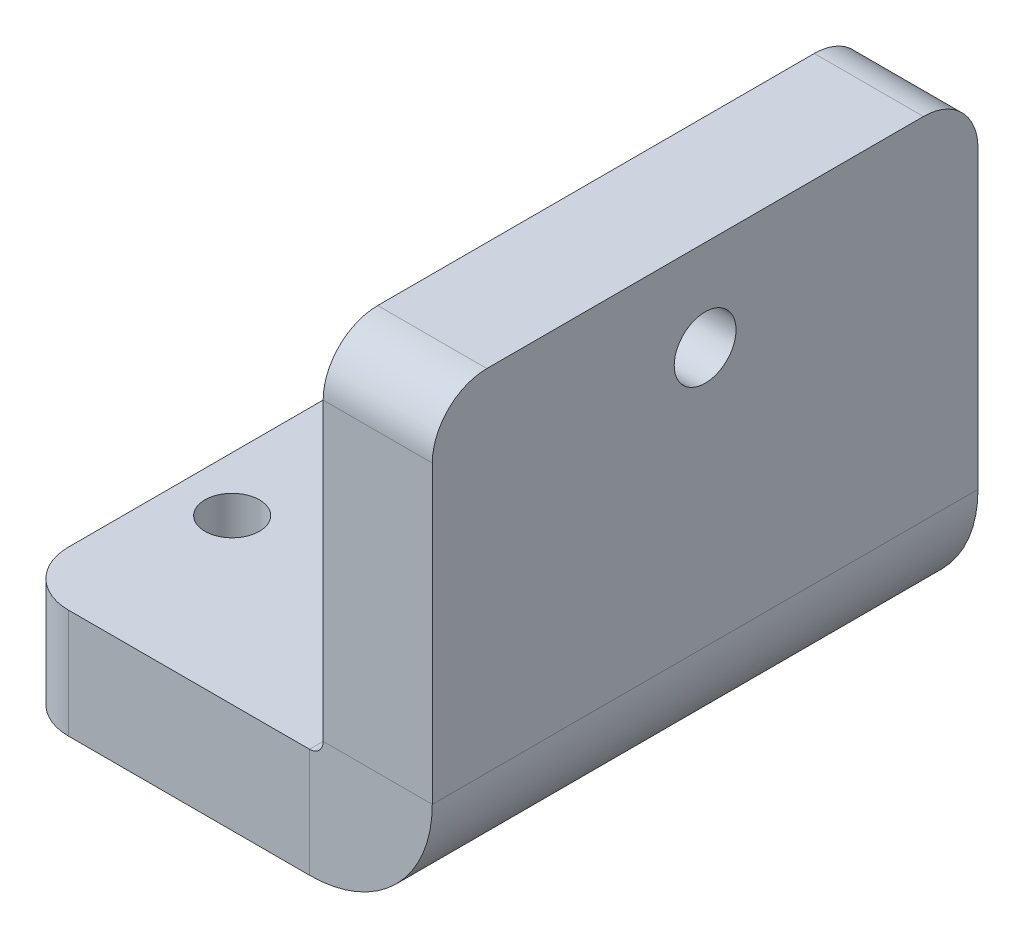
ISO-10303-21;
HEADER;
FILE_DESCRIPTION(('STEP AP214'),'2;1');
FILE_NAME('part.step','',(''),(''),'','','');
FILE_SCHEMA(('AUTOMOTIVE_DESIGN { 1 0 10303 214 1 1 1 1 }'));
ENDSEC;
DATA;
#1=APPLICATION_CONTEXT('core data for automotive mechanical design processes');
#2=APPLICATION_PROTOCOL_DEFINITION('international standard','automotive_design',2000,#1);
#3=PRODUCT_CONTEXT('',#1,'mechanical');
#4=PRODUCT('Part','Part','',(#3));
#5=PRODUCT_RELATED_PRODUCT_CATEGORY('part','',(#4));
#6=PRODUCT_DEFINITION_FORMATION('','',#4);
#7=PRODUCT_DEFINITION_CONTEXT('part definition',#1,'design');
#8=PRODUCT_DEFINITION('design','',#6,#7);
#9=PRODUCT_DEFINITION_SHAPE('','',#8);
#10=(LENGTH_UNIT() NAMED_UNIT(*) SI_UNIT(.MILLI.,.METRE.));
#11=(NAMED_UNIT(*) PLANE_ANGLE_UNIT() SI_UNIT($,.RADIAN.));
#12=(NAMED_UNIT(*) SI_UNIT($,.STERADIAN.) SOLID_ANGLE_UNIT());
#13=UNCERTAINTY_MEASURE_WITH_UNIT(LENGTH_MEASURE(1.E-05),#10,'distance_accuracy_value','');
#14=(GEOMETRIC_REPRESENTATION_CONTEXT(3) GLOBAL_UNCERTAINTY_ASSIGNED_CONTEXT((#13)) GLOBAL_UNIT_ASSIGNED_CONTEXT((#10,
#11,#12)) REPRESENTATION_CONTEXT('',''));
#15=CARTESIAN_POINT('',(0.,0.,0.));
#16=DIRECTION('',(0.,0.,1.));
#17=DIRECTION('',(1.,0.,0.));
#18=AXIS2_PLACEMENT_3D('',#15,#16,#17);
#19=CARTESIAN_POINT('',(0.,0.75,15.));
#20=DIRECTION('',(0.,0.,1.));
#21=DIRECTION('',(1.,0.,0.));
#22=AXIS2_PLACEMENT_3D('',#19,#20,#21);
#23=PLANE('',#22);
#24=DIRECTION('',(1.,0.,0.));
#25=VECTOR('',#24,1.);
#26=CARTESIAN_POINT('',(0.,0.75,15.));
#27=LINE('',#26,#25);
#28=CARTESIAN_POINT('',(0.,0.75,15.));
#29=VERTEX_POINT('',#28);
#30=CARTESIAN_POINT('',(6.,0.75,15.));
#31=VERTEX_POINT('',#30);
#32=EDGE_CURVE('E134',#29,#31,#27,.T.);
#33=ORIENTED_EDGE('',*,*,#32,.F.);
#34=CARTESIAN_POINT('',(-0.75,0.75,15.));
#35=DIRECTION('',(0.,0.,-1.));
#36=DIRECTION('',(-1.,0.,0.));
#37=AXIS2_PLACEMENT_3D('',#34,#35,#36);
#38=CIRCLE('',#37,0.75);
#39=CARTESIAN_POINT('',(-0.750000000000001,0.,15.));
#40=VERTEX_POINT('',#39);
#41=EDGE_CURVE('E138',#40,#29,#38,.F.);
#42=ORIENTED_EDGE('',*,*,#41,.F.);
#43=DIRECTION('',(0.,1.,0.));
#44=VECTOR('',#43,1.);
#45=CARTESIAN_POINT('',(-0.750000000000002,-6.,15.));
#46=LINE('',#45,#44);
#47=CARTESIAN_POINT('',(-0.750000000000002,-6.,15.));
#48=VERTEX_POINT('',#47);
#49=EDGE_CURVE('E143',#48,#40,#46,.T.);
#50=ORIENTED_EDGE('',*,*,#49,.F.);
#51=CARTESIAN_POINT('',(-0.75,0.75,15.));
#52=DIRECTION('',(0.,0.,1.));
#53=DIRECTION('',(1.,0.,0.));
#54=AXIS2_PLACEMENT_3D('',#51,#52,#53);
#55=CIRCLE('',#54,6.75);
#56=EDGE_CURVE('E140',#48,#31,#55,.T.);
#57=ORIENTED_EDGE('',*,*,#56,.T.);
#58=EDGE_LOOP('',(#33,#42,#50,#57));
#59=FACE_BOUND('',#58,.T.);
#60=ADVANCED_FACE('F43',(#59),#23,.T.);
#61=CARTESIAN_POINT('',(-0.750000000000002,-6.,15.));
#62=DIRECTION('',(0.,0.,1.));
#63=DIRECTION('',(1.,0.,0.));
#64=AXIS2_PLACEMENT_3D('',#61,#62,#63);
#65=PLANE('',#64);
#66=DIRECTION('',(0.,1.,0.));
#67=VECTOR('',#66,1.);
#68=CARTESIAN_POINT('',(6.,0.,15.));
#69=LINE('',#68,#67);
#70=CARTESIAN_POINT('',(6.,17.,15.));
#71=VERTEX_POINT('',#70);
#72=EDGE_CURVE('E161',#31,#71,#69,.T.);
#73=ORIENTED_EDGE('',*,*,#72,.T.);
#74=DIRECTION('',(1.,0.,0.));
#75=VECTOR('',#74,1.);
#76=CARTESIAN_POINT('',(-0.750000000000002,17.,15.));
#77=LINE('',#76,#75);
#78=CARTESIAN_POINT('',(0.,17.,15.));
#79=VERTEX_POINT('',#78);
#80=EDGE_CURVE('E51',#71,#79,#77,.F.);
#81=ORIENTED_EDGE('',*,*,#80,.T.);
#82=DIRECTION('',(0.,1.,0.));
#83=VECTOR('',#82,1.);
#84=CARTESIAN_POINT('',(0.,0.,15.));
#85=LINE('',#84,#83);
#86=EDGE_CURVE('E150',#29,#79,#85,.T.);
#87=ORIENTED_EDGE('',*,*,#86,.F.);
#88=ORIENTED_EDGE('',*,*,#32,.T.);
#89=EDGE_LOOP('',(#73,#81,#87,#88));
#90=FACE_BOUND('',#89,.T.);
#91=ADVANCED_FACE('F160',(#90),#65,.T.);
#92=CARTESIAN_POINT('',(-0.750000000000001,0.,-15.));
#93=DIRECTION('',(0.,0.,-1.));
#94=DIRECTION('',(-1.,0.,0.));
#95=AXIS2_PLACEMENT_3D('',#92,#93,#94);
#96=PLANE('',#95);
#97=DIRECTION('',(0.,-1.,0.));
#98=VECTOR('',#97,1.);
#99=CARTESIAN_POINT('',(-0.750000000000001,0.,-15.));
#100=LINE('',#99,#98);
#101=CARTESIAN_POINT('',(-0.750000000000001,0.,-15.));
#102=VERTEX_POINT('',#101);
#103=CARTESIAN_POINT('',(-0.750000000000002,-6.,-15.));
#104=VERTEX_POINT('',#103);
#105=EDGE_CURVE('E206',#102,#104,#100,.T.);
#106=ORIENTED_EDGE('',*,*,#105,.F.);
#107=CARTESIAN_POINT('',(-0.75,0.75,-15.));
#108=DIRECTION('',(0.,0.,-1.));
#109=DIRECTION('',(-1.,0.,0.));
#110=AXIS2_PLACEMENT_3D('',#107,#108,#109);
#111=CIRCLE('',#110,0.75);
#112=CARTESIAN_POINT('',(0.,0.75,-15.));
#113=VERTEX_POINT('',#112);
#114=EDGE_CURVE('E180',#102,#113,#111,.F.);
#115=ORIENTED_EDGE('',*,*,#114,.T.);
#116=DIRECTION('',(-1.,0.,0.));
#117=VECTOR('',#116,1.);
#118=CARTESIAN_POINT('',(6.,0.75,-15.));
#119=LINE('',#118,#117);
#120=CARTESIAN_POINT('',(6.,0.75,-15.));
#121=VERTEX_POINT('',#120);
#122=EDGE_CURVE('E204',#121,#113,#119,.T.);
#123=ORIENTED_EDGE('',*,*,#122,.F.);
#124=CARTESIAN_POINT('',(-0.75,0.75,-15.));
#125=DIRECTION('',(0.,0.,1.));
#126=DIRECTION('',(1.,0.,0.));
#127=AXIS2_PLACEMENT_3D('',#124,#125,#126);
#128=CIRCLE('',#127,6.75);
#129=EDGE_CURVE('E186',#104,#121,#128,.T.);
#130=ORIENTED_EDGE('',*,*,#129,.F.);
#131=EDGE_LOOP('',(#106,#115,#123,#130));
#132=FACE_BOUND('',#131,.T.);
#133=ADVANCED_FACE('F299',(#132),#96,.T.);
#134=CARTESIAN_POINT('',(6.,0.75,-15.));
#135=DIRECTION('',(0.,0.,-1.));
#136=DIRECTION('',(-1.,0.,0.));
#137=AXIS2_PLACEMENT_3D('',#134,#135,#136);
#138=PLANE('',#137);
#139=DIRECTION('',(1.,0.,0.));
#140=VECTOR('',#139,1.);
#141=CARTESIAN_POINT('',(-17.,-6.,-15.));
#142=LINE('',#141,#140);
#143=CARTESIAN_POINT('',(-14.,-6.,-15.));
#144=VERTEX_POINT('',#143);
#145=EDGE_CURVE('E184',#144,#104,#142,.T.);
#146=ORIENTED_EDGE('',*,*,#145,.F.);
#147=DIRECTION('',(0.,1.,0.));
#148=VECTOR('',#147,1.);
#149=CARTESIAN_POINT('',(-14.,0.75,-15.));
#150=LINE('',#149,#148);
#151=CARTESIAN_POINT('',(-14.,0.,-15.));
#152=VERTEX_POINT('',#151);
#153=EDGE_CURVE('E142',#144,#152,#150,.T.);
#154=ORIENTED_EDGE('',*,*,#153,.T.);
#155=DIRECTION('',(1.,0.,0.));
#156=VECTOR('',#155,1.);
#157=CARTESIAN_POINT('',(-17.,0.,-15.));
#158=LINE('',#157,#156);
#159=EDGE_CURVE('E182',#152,#102,#158,.T.);
#160=ORIENTED_EDGE('',*,*,#159,.T.);
#161=ORIENTED_EDGE('',*,*,#105,.T.);
#162=EDGE_LOOP('',(#146,#154,#160,#161));
#163=FACE_BOUND('',#162,.T.);
#164=ADVANCED_FACE('F336',(#163),#138,.T.);
#165=CARTESIAN_POINT('',(6.,0.,15.));
#166=DIRECTION('',(-1.,0.,0.));
#167=DIRECTION('',(0.,0.,1.));
#168=AXIS2_PLACEMENT_3D('',#165,#166,#167);
#169=PLANE('',#168);
#170=CARTESIAN_POINT('',(6.,15.,0.));
#171=DIRECTION('',(-1.,0.,0.));
#172=DIRECTION('',(0.,0.,1.));
#173=AXIS2_PLACEMENT_3D('',#170,#171,#172);
#174=CIRCLE('',#173,1.7);
#175=CARTESIAN_POINT('',(6.,15.,1.7));
#176=VERTEX_POINT('',#175);
#177=EDGE_CURVE('E260',#176,#176,#174,.T.);
#178=ORIENTED_EDGE('',*,*,#177,.T.);
#179=EDGE_LOOP('',(#178));
#180=FACE_BOUND('',#179,.T.);
#181=DIRECTION('',(0.,1.,0.));
#182=VECTOR('',#181,1.);
#183=CARTESIAN_POINT('',(6.,0.,-15.));
#184=LINE('',#183,#182);
#185=CARTESIAN_POINT('',(6.,17.,-15.));
#186=VERTEX_POINT('',#185);
#187=EDGE_CURVE('E175',#121,#186,#184,.T.);
#188=ORIENTED_EDGE('',*,*,#187,.T.);
#189=CARTESIAN_POINT('',(6.,17.,-12.));
#190=DIRECTION('',(-1.,0.,0.));
#191=DIRECTION('',(0.,0.,1.));
#192=AXIS2_PLACEMENT_3D('',#189,#190,#191);
#193=CIRCLE('',#192,3.);
#194=CARTESIAN_POINT('',(6.,20.,-12.));
#195=VERTEX_POINT('',#194);
#196=EDGE_CURVE('E231',#186,#195,#193,.F.);
#197=ORIENTED_EDGE('',*,*,#196,.T.);
#198=DIRECTION('',(0.,0.,-1.));
#199=VECTOR('',#198,1.);
#200=CARTESIAN_POINT('',(6.,20.,15.));
#201=LINE('',#200,#199);
#202=CARTESIAN_POINT('',(6.,20.,12.));
#203=VERTEX_POINT('',#202);
#204=EDGE_CURVE('E202',#203,#195,#201,.T.);
#205=ORIENTED_EDGE('',*,*,#204,.F.);
#206=CARTESIAN_POINT('',(6.,17.,12.));
#207=DIRECTION('',(-1.,0.,0.));
#208=DIRECTION('',(0.,0.,1.));
#209=AXIS2_PLACEMENT_3D('',#206,#207,#208);
#210=CIRCLE('',#209,3.);
#211=EDGE_CURVE('E229',#203,#71,#210,.F.);
#212=ORIENTED_EDGE('',*,*,#211,.T.);
#213=ORIENTED_EDGE('',*,*,#72,.F.);
#214=DIRECTION('',(0.,0.,-1.));
#215=VECTOR('',#214,1.);
#216=CARTESIAN_POINT('',(6.,0.75,15.));
#217=LINE('',#216,#215);
#218=EDGE_CURVE('E174',#31,#121,#217,.T.);
#219=ORIENTED_EDGE('',*,*,#218,.T.);
#220=EDGE_LOOP('',(#188,#197,#205,#212,#213,#219));
#221=FACE_BOUND('',#220,.T.);
#222=ADVANCED_FACE('F249',(#180,#221),#169,.F.);
#223=CARTESIAN_POINT('',(0.,20.,15.));
#224=DIRECTION('',(0.,1.,0.));
#225=DIRECTION('',(0.,0.,1.));
#226=AXIS2_PLACEMENT_3D('',#223,#224,#225);
#227=PLANE('',#226);
#228=ORIENTED_EDGE('',*,*,#204,.T.);
#229=DIRECTION('',(1.,0.,0.));
#230=VECTOR('',#229,1.);
#231=CARTESIAN_POINT('',(0.,20.,-12.));
#232=LINE('',#231,#230);
#233=CARTESIAN_POINT('',(0.,20.,-12.));
#234=VERTEX_POINT('',#233);
#235=EDGE_CURVE('E65',#195,#234,#232,.F.);
#236=ORIENTED_EDGE('',*,*,#235,.T.);
#237=DIRECTION('',(0.,0.,-1.));
#238=VECTOR('',#237,1.);
#239=CARTESIAN_POINT('',(0.,20.,15.));
#240=LINE('',#239,#238);
#241=CARTESIAN_POINT('',(0.,20.,12.));
#242=VERTEX_POINT('',#241);
#243=EDGE_CURVE('E157',#242,#234,#240,.T.);
#244=ORIENTED_EDGE('',*,*,#243,.F.);
#245=DIRECTION('',(1.,0.,0.));
#246=VECTOR('',#245,1.);
#247=CARTESIAN_POINT('',(0.,20.,12.));
#248=LINE('',#247,#246);
#249=EDGE_CURVE('E233',#242,#203,#248,.T.);
#250=ORIENTED_EDGE('',*,*,#249,.T.);
#251=EDGE_LOOP('',(#228,#236,#244,#250));
#252=FACE_BOUND('',#251,.T.);
#253=ADVANCED_FACE('F250',(#252),#227,.T.);
#254=CARTESIAN_POINT('',(0.,0.,15.));
#255=DIRECTION('',(-1.,0.,0.));
#256=DIRECTION('',(0.,0.,1.));
#257=AXIS2_PLACEMENT_3D('',#254,#255,#256);
#258=PLANE('',#257);
#259=CARTESIAN_POINT('',(0.,15.,0.));
#260=DIRECTION('',(-1.,0.,0.));
#261=DIRECTION('',(0.,0.,1.));
#262=AXIS2_PLACEMENT_3D('',#259,#260,#261);
#263=CIRCLE('',#262,3.275);
#264=CARTESIAN_POINT('',(0.,15.,3.275));
#265=VERTEX_POINT('',#264);
#266=EDGE_CURVE('E279',#265,#265,#263,.T.);
#267=ORIENTED_EDGE('',*,*,#266,.F.);
#268=EDGE_LOOP('',(#267));
#269=FACE_BOUND('',#268,.T.);
#270=ORIENTED_EDGE('',*,*,#243,.T.);
#271=CARTESIAN_POINT('',(0.,17.,-12.));
#272=DIRECTION('',(-1.,0.,0.));
#273=DIRECTION('',(0.,0.,1.));
#274=AXIS2_PLACEMENT_3D('',#271,#272,#273);
#275=CIRCLE('',#274,3.);
#276=CARTESIAN_POINT('',(0.,17.,-15.));
#277=VERTEX_POINT('',#276);
#278=EDGE_CURVE('E239',#234,#277,#275,.T.);
#279=ORIENTED_EDGE('',*,*,#278,.T.);
#280=DIRECTION('',(0.,1.,0.));
#281=VECTOR('',#280,1.);
#282=CARTESIAN_POINT('',(0.,0.,-15.));
#283=LINE('',#282,#281);
#284=EDGE_CURVE('E153',#113,#277,#283,.T.);
#285=ORIENTED_EDGE('',*,*,#284,.F.);
#286=DIRECTION('',(0.,0.,-1.));
#287=VECTOR('',#286,1.);
#288=CARTESIAN_POINT('',(0.,0.75,15.));
#289=LINE('',#288,#287);
#290=EDGE_CURVE('E148',#29,#113,#289,.T.);
#291=ORIENTED_EDGE('',*,*,#290,.F.);
#292=ORIENTED_EDGE('',*,*,#86,.T.);
#293=CARTESIAN_POINT('',(0.,17.,12.));
#294=DIRECTION('',(-1.,0.,0.));
#295=DIRECTION('',(0.,0.,1.));
#296=AXIS2_PLACEMENT_3D('',#293,#294,#295);
#297=CIRCLE('',#296,3.);
#298=EDGE_CURVE('E237',#79,#242,#297,.T.);
#299=ORIENTED_EDGE('',*,*,#298,.T.);
#300=EDGE_LOOP('',(#270,#279,#285,#291,#292,#299));
#301=FACE_BOUND('',#300,.T.);
#302=ADVANCED_FACE('F149',(#269,#301),#258,.T.);
#303=CARTESIAN_POINT('',(-0.75,0.75,15.));
#304=DIRECTION('',(0.,0.,-1.));
#305=DIRECTION('',(-1.,0.,0.));
#306=AXIS2_PLACEMENT_3D('',#303,#304,#305);
#307=CYLINDRICAL_SURFACE('',#306,0.75);
#308=ORIENTED_EDGE('',*,*,#114,.F.);
#309=DIRECTION('',(0.,0.,-1.));
#310=VECTOR('',#309,1.);
#311=CARTESIAN_POINT('',(-0.750000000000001,0.,15.));
#312=LINE('',#311,#310);
#313=EDGE_CURVE('E158',#40,#102,#312,.T.);
#314=ORIENTED_EDGE('',*,*,#313,.F.);
#315=ORIENTED_EDGE('',*,*,#41,.T.);
#316=ORIENTED_EDGE('',*,*,#290,.T.);
#317=EDGE_LOOP('',(#308,#314,#315,#316));
#318=FACE_BOUND('',#317,.T.);
#319=ADVANCED_FACE('F164',(#318),#307,.F.);
#320=CARTESIAN_POINT('',(-17.,0.,15.));
#321=DIRECTION('',(0.,1.,0.));
#322=DIRECTION('',(0.,0.,1.));
#323=AXIS2_PLACEMENT_3D('',#320,#321,#322);
#324=PLANE('',#323);
#325=CARTESIAN_POINT('',(-14.,0.,-6.));
#326=DIRECTION('',(0.,1.,0.));
#327=DIRECTION('',(0.,0.,1.));
#328=AXIS2_PLACEMENT_3D('',#325,#326,#327);
#329=CIRCLE('',#328,1.5);
#330=CARTESIAN_POINT('',(-14.,0.,-4.5));
#331=VERTEX_POINT('',#330);
#332=EDGE_CURVE('E263',#331,#331,#329,.T.);
#333=ORIENTED_EDGE('',*,*,#332,.F.);
#334=EDGE_LOOP('',(#333));
#335=FACE_BOUND('',#334,.T.);
#336=CARTESIAN_POINT('',(-14.,0.,6.));
#337=DIRECTION('',(0.,1.,0.));
#338=DIRECTION('',(0.,0.,-1.));
#339=AXIS2_PLACEMENT_3D('',#336,#337,#338);
#340=CIRCLE('',#339,1.5);
#341=CARTESIAN_POINT('',(-14.,0.,4.50000000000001));
#342=VERTEX_POINT('',#341);
#343=EDGE_CURVE('E259',#342,#342,#340,.T.);
#344=ORIENTED_EDGE('',*,*,#343,.F.);
#345=EDGE_LOOP('',(#344));
#346=FACE_BOUND('',#345,.T.);
#347=ORIENTED_EDGE('',*,*,#159,.F.);
#348=CARTESIAN_POINT('',(-14.,0.,-12.));
#349=DIRECTION('',(0.,1.,0.));
#350=DIRECTION('',(0.,0.,1.));
#351=AXIS2_PLACEMENT_3D('',#348,#349,#350);
#352=CIRCLE('',#351,3.);
#353=CARTESIAN_POINT('',(-17.,0.,-12.));
#354=VERTEX_POINT('',#353);
#355=EDGE_CURVE('E215',#152,#354,#352,.T.);
#356=ORIENTED_EDGE('',*,*,#355,.T.);
#357=DIRECTION('',(0.,0.,-1.));
#358=VECTOR('',#357,1.);
#359=CARTESIAN_POINT('',(-17.,0.,15.));
#360=LINE('',#359,#358);
#361=CARTESIAN_POINT('',(-17.,0.,12.));
#362=VERTEX_POINT('',#361);
#363=EDGE_CURVE('E197',#362,#354,#360,.T.);
#364=ORIENTED_EDGE('',*,*,#363,.F.);
#365=CARTESIAN_POINT('',(-14.,0.,12.));
#366=DIRECTION('',(0.,1.,0.));
#367=DIRECTION('',(0.,0.,1.));
#368=AXIS2_PLACEMENT_3D('',#365,#366,#367);
#369=CIRCLE('',#368,3.);
#370=CARTESIAN_POINT('',(-14.,0.,15.));
#371=VERTEX_POINT('',#370);
#372=EDGE_CURVE('E213',#362,#371,#369,.T.);
#373=ORIENTED_EDGE('',*,*,#372,.T.);
#374=DIRECTION('',(1.,0.,0.));
#375=VECTOR('',#374,1.);
#376=CARTESIAN_POINT('',(-17.,0.,15.));
#377=LINE('',#376,#375);
#378=EDGE_CURVE('E166',#371,#40,#377,.T.);
#379=ORIENTED_EDGE('',*,*,#378,.T.);
#380=ORIENTED_EDGE('',*,*,#313,.T.);
#381=EDGE_LOOP('',(#347,#356,#364,#373,#379,#380));
#382=FACE_BOUND('',#381,.T.);
#383=ADVANCED_FACE('F291',(#335,#346,#382),#324,.T.);
#384=CARTESIAN_POINT('',(-17.,-6.,15.));
#385=DIRECTION('',(-1.,0.,0.));
#386=DIRECTION('',(0.,0.,1.));
#387=AXIS2_PLACEMENT_3D('',#384,#385,#386);
#388=PLANE('',#387);
#389=ORIENTED_EDGE('',*,*,#363,.T.);
#390=DIRECTION('',(0.,1.,0.));
#391=VECTOR('',#390,1.);
#392=CARTESIAN_POINT('',(-17.,-6.,-12.));
#393=LINE('',#392,#391);
#394=CARTESIAN_POINT('',(-17.,-6.,-12.));
#395=VERTEX_POINT('',#394);
#396=EDGE_CURVE('E220',#354,#395,#393,.F.);
#397=ORIENTED_EDGE('',*,*,#396,.T.);
#398=DIRECTION('',(0.,0.,-1.));
#399=VECTOR('',#398,1.);
#400=CARTESIAN_POINT('',(-17.,-6.,15.));
#401=LINE('',#400,#399);
#402=CARTESIAN_POINT('',(-17.,-6.,12.));
#403=VERTEX_POINT('',#402);
#404=EDGE_CURVE('E194',#403,#395,#401,.T.);
#405=ORIENTED_EDGE('',*,*,#404,.F.);
#406=DIRECTION('',(0.,1.,0.));
#407=VECTOR('',#406,1.);
#408=CARTESIAN_POINT('',(-17.,0.,12.));
#409=LINE('',#408,#407);
#410=EDGE_CURVE('E217',#403,#362,#409,.T.);
#411=ORIENTED_EDGE('',*,*,#410,.T.);
#412=EDGE_LOOP('',(#389,#397,#405,#411));
#413=FACE_BOUND('',#412,.T.);
#414=ADVANCED_FACE('F330',(#413),#388,.T.);
#415=CARTESIAN_POINT('',(-17.,-6.,15.));
#416=DIRECTION('',(0.,1.,0.));
#417=DIRECTION('',(0.,0.,1.));
#418=AXIS2_PLACEMENT_3D('',#415,#416,#417);
#419=PLANE('',#418);
#420=CARTESIAN_POINT('',(-14.,-6.,-6.));
#421=DIRECTION('',(0.,1.,0.));
#422=DIRECTION('',(0.,0.,1.));
#423=AXIS2_PLACEMENT_3D('',#420,#421,#422);
#424=CIRCLE('',#423,1.5);
#425=CARTESIAN_POINT('',(-14.,-6.,-4.5));
#426=VERTEX_POINT('',#425);
#427=EDGE_CURVE('E178',#426,#426,#424,.T.);
#428=ORIENTED_EDGE('',*,*,#427,.T.);
#429=EDGE_LOOP('',(#428));
#430=FACE_BOUND('',#429,.T.);
#431=CARTESIAN_POINT('',(-14.,-6.,6.));
#432=DIRECTION('',(0.,1.,0.));
#433=DIRECTION('',(0.,0.,-1.));
#434=AXIS2_PLACEMENT_3D('',#431,#432,#433);
#435=CIRCLE('',#434,1.5);
#436=CARTESIAN_POINT('',(-14.,-6.,4.50000000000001));
#437=VERTEX_POINT('',#436);
#438=EDGE_CURVE('E256',#437,#437,#435,.T.);
#439=ORIENTED_EDGE('',*,*,#438,.T.);
#440=EDGE_LOOP('',(#439));
#441=FACE_BOUND('',#440,.T.);
#442=ORIENTED_EDGE('',*,*,#404,.T.);
#443=CARTESIAN_POINT('',(-14.,-6.,-12.));
#444=DIRECTION('',(0.,1.,0.));
#445=DIRECTION('',(0.,0.,1.));
#446=AXIS2_PLACEMENT_3D('',#443,#444,#445);
#447=CIRCLE('',#446,3.);
#448=EDGE_CURVE('E224',#395,#144,#447,.F.);
#449=ORIENTED_EDGE('',*,*,#448,.T.);
#450=ORIENTED_EDGE('',*,*,#145,.T.);
#451=DIRECTION('',(0.,0.,-1.));
#452=VECTOR('',#451,1.);
#453=CARTESIAN_POINT('',(-0.750000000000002,-6.,15.));
#454=LINE('',#453,#452);
#455=EDGE_CURVE('E191',#48,#104,#454,.T.);
#456=ORIENTED_EDGE('',*,*,#455,.F.);
#457=DIRECTION('',(1.,0.,0.));
#458=VECTOR('',#457,1.);
#459=CARTESIAN_POINT('',(-17.,-6.,15.));
#460=LINE('',#459,#458);
#461=CARTESIAN_POINT('',(-14.,-6.,15.));
#462=VERTEX_POINT('',#461);
#463=EDGE_CURVE('E168',#462,#48,#460,.T.);
#464=ORIENTED_EDGE('',*,*,#463,.F.);
#465=CARTESIAN_POINT('',(-14.,-6.,12.));
#466=DIRECTION('',(0.,1.,0.));
#467=DIRECTION('',(0.,0.,1.));
#468=AXIS2_PLACEMENT_3D('',#465,#466,#467);
#469=CIRCLE('',#468,3.);
#470=EDGE_CURVE('E222',#462,#403,#469,.F.);
#471=ORIENTED_EDGE('',*,*,#470,.T.);
#472=EDGE_LOOP('',(#442,#449,#450,#456,#464,#471));
#473=FACE_BOUND('',#472,.T.);
#474=ADVANCED_FACE('F326',(#430,#441,#473),#419,.F.);
#475=CARTESIAN_POINT('',(-0.75,0.75,15.));
#476=DIRECTION('',(0.,0.,-1.));
#477=DIRECTION('',(-1.,0.,0.));
#478=AXIS2_PLACEMENT_3D('',#475,#476,#477);
#479=CYLINDRICAL_SURFACE('',#478,6.75);
#480=ORIENTED_EDGE('',*,*,#129,.T.);
#481=ORIENTED_EDGE('',*,*,#218,.F.);
#482=ORIENTED_EDGE('',*,*,#56,.F.);
#483=ORIENTED_EDGE('',*,*,#455,.T.);
#484=EDGE_LOOP('',(#480,#481,#482,#483));
#485=FACE_BOUND('',#484,.T.);
#486=ADVANCED_FACE('F342',(#485),#479,.T.);
#487=CARTESIAN_POINT('',(-0.75,0.75,15.));
#488=DIRECTION('',(0.,0.,-1.));
#489=DIRECTION('',(-1.,0.,0.));
#490=AXIS2_PLACEMENT_3D('',#487,#488,#489);
#491=PLANE('',#490);
#492=ORIENTED_EDGE('',*,*,#378,.F.);
#493=DIRECTION('',(0.,1.,0.));
#494=VECTOR('',#493,1.);
#495=CARTESIAN_POINT('',(-14.,-6.,15.));
#496=LINE('',#495,#494);
#497=EDGE_CURVE('E11',#371,#462,#496,.F.);
#498=ORIENTED_EDGE('',*,*,#497,.T.);
#499=ORIENTED_EDGE('',*,*,#463,.T.);
#500=ORIENTED_EDGE('',*,*,#49,.T.);
#501=EDGE_LOOP('',(#492,#498,#499,#500));
#502=FACE_BOUND('',#501,.T.);
#503=ADVANCED_FACE('F381',(#502),#491,.F.);
#504=CARTESIAN_POINT('',(-0.75,0.75,-15.));
#505=DIRECTION('',(0.,0.,-1.));
#506=DIRECTION('',(-1.,0.,0.));
#507=AXIS2_PLACEMENT_3D('',#504,#505,#506);
#508=PLANE('',#507);
#509=ORIENTED_EDGE('',*,*,#284,.T.);
#510=DIRECTION('',(1.,0.,0.));
#511=VECTOR('',#510,1.);
#512=CARTESIAN_POINT('',(-0.75,17.,-15.));
#513=LINE('',#512,#511);
#514=EDGE_CURVE('E226',#277,#186,#513,.T.);
#515=ORIENTED_EDGE('',*,*,#514,.T.);
#516=ORIENTED_EDGE('',*,*,#187,.F.);
#517=ORIENTED_EDGE('',*,*,#122,.T.);
#518=EDGE_LOOP('',(#509,#515,#516,#517));
#519=FACE_BOUND('',#518,.T.);
#520=ADVANCED_FACE('F244',(#519),#508,.T.);
#521=CARTESIAN_POINT('',(-14.,0.75,-12.));
#522=DIRECTION('',(0.,1.,0.));
#523=DIRECTION('',(0.,0.,1.));
#524=AXIS2_PLACEMENT_3D('',#521,#522,#523);
#525=CYLINDRICAL_SURFACE('',#524,3.);
#526=ORIENTED_EDGE('',*,*,#448,.F.);
#527=ORIENTED_EDGE('',*,*,#396,.F.);
#528=ORIENTED_EDGE('',*,*,#355,.F.);
#529=ORIENTED_EDGE('',*,*,#153,.F.);
#530=EDGE_LOOP('',(#526,#527,#528,#529));
#531=FACE_BOUND('',#530,.T.);
#532=ADVANCED_FACE('F303',(#531),#525,.T.);
#533=CARTESIAN_POINT('',(-0.75,17.,-12.));
#534=DIRECTION('',(1.,0.,0.));
#535=DIRECTION('',(0.,0.,-1.));
#536=AXIS2_PLACEMENT_3D('',#533,#534,#535);
#537=CYLINDRICAL_SURFACE('',#536,3.);
#538=ORIENTED_EDGE('',*,*,#278,.F.);
#539=ORIENTED_EDGE('',*,*,#235,.F.);
#540=ORIENTED_EDGE('',*,*,#196,.F.);
#541=ORIENTED_EDGE('',*,*,#514,.F.);
#542=EDGE_LOOP('',(#538,#539,#540,#541));
#543=FACE_BOUND('',#542,.T.);
#544=ADVANCED_FACE('F246',(#543),#537,.T.);
#545=CARTESIAN_POINT('',(0.,17.,12.));
#546=DIRECTION('',(1.,0.,0.));
#547=DIRECTION('',(0.,0.,-1.));
#548=AXIS2_PLACEMENT_3D('',#545,#546,#547);
#549=CYLINDRICAL_SURFACE('',#548,3.);
#550=ORIENTED_EDGE('',*,*,#298,.F.);
#551=ORIENTED_EDGE('',*,*,#80,.F.);
#552=ORIENTED_EDGE('',*,*,#211,.F.);
#553=ORIENTED_EDGE('',*,*,#249,.F.);
#554=EDGE_LOOP('',(#550,#551,#552,#553));
#555=FACE_BOUND('',#554,.T.);
#556=ADVANCED_FACE('F253',(#555),#549,.T.);
#557=CARTESIAN_POINT('',(-14.,-6.,12.));
#558=DIRECTION('',(0.,-1.,0.));
#559=DIRECTION('',(0.,0.,-1.));
#560=AXIS2_PLACEMENT_3D('',#557,#558,#559);
#561=CYLINDRICAL_SURFACE('',#560,3.);
#562=ORIENTED_EDGE('',*,*,#470,.F.);
#563=ORIENTED_EDGE('',*,*,#497,.F.);
#564=ORIENTED_EDGE('',*,*,#372,.F.);
#565=ORIENTED_EDGE('',*,*,#410,.F.);
#566=EDGE_LOOP('',(#562,#563,#564,#565));
#567=FACE_BOUND('',#566,.T.);
#568=ADVANCED_FACE('F45',(#567),#561,.T.);
#569=CARTESIAN_POINT('',(-14.,-6.,6.));
#570=DIRECTION('',(0.,1.,0.));
#571=DIRECTION('',(0.,0.,1.));
#572=AXIS2_PLACEMENT_3D('',#569,#570,#571);
#573=CYLINDRICAL_SURFACE('',#572,1.5);
#574=ORIENTED_EDGE('',*,*,#438,.F.);
#575=EDGE_LOOP('',(#574));
#576=FACE_BOUND('',#575,.T.);
#577=ORIENTED_EDGE('',*,*,#343,.T.);
#578=EDGE_LOOP('',(#577));
#579=FACE_BOUND('',#578,.T.);
#580=ADVANCED_FACE('F312',(#576,#579),#573,.F.);
#581=CARTESIAN_POINT('',(-14.,-6.,-6.));
#582=DIRECTION('',(0.,1.,0.));
#583=DIRECTION('',(0.,0.,1.));
#584=AXIS2_PLACEMENT_3D('',#581,#582,#583);
#585=CYLINDRICAL_SURFACE('',#584,1.5);
#586=ORIENTED_EDGE('',*,*,#427,.F.);
#587=EDGE_LOOP('',(#586));
#588=FACE_BOUND('',#587,.T.);
#589=ORIENTED_EDGE('',*,*,#332,.T.);
#590=EDGE_LOOP('',(#589));
#591=FACE_BOUND('',#590,.T.);
#592=ADVANCED_FACE('F317',(#588,#591),#585,.F.);
#593=CARTESIAN_POINT('',(0.,15.,0.));
#594=DIRECTION('',(-1.,0.,0.));
#595=DIRECTION('',(0.,0.,1.));
#596=AXIS2_PLACEMENT_3D('',#593,#594,#595);
#597=CYLINDRICAL_SURFACE('',#596,1.7);
#598=ORIENTED_EDGE('',*,*,#177,.F.);
#599=EDGE_LOOP('',(#598));
#600=FACE_BOUND('',#599,.T.);
#601=CARTESIAN_POINT('',(3.4,15.,0.));
#602=DIRECTION('',(-1.,0.,0.));
#603=DIRECTION('',(0.,0.,1.));
#604=AXIS2_PLACEMENT_3D('',#601,#602,#603);
#605=CIRCLE('',#604,1.7);
#606=CARTESIAN_POINT('',(3.4,15.,1.7));
#607=VERTEX_POINT('',#606);
#608=EDGE_CURVE('E270',#607,#607,#605,.T.);
#609=ORIENTED_EDGE('',*,*,#608,.T.);
#610=EDGE_LOOP('',(#609));
#611=FACE_BOUND('',#610,.T.);
#612=ADVANCED_FACE('F355',(#600,#611),#597,.F.);
#613=CARTESIAN_POINT('',(3.4,18.25,0.));
#614=DIRECTION('',(1.,0.,0.));
#615=DIRECTION('',(0.,0.,-1.));
#616=AXIS2_PLACEMENT_3D('',#613,#614,#615);
#617=PLANE('',#616);
#618=ORIENTED_EDGE('',*,*,#608,.F.);
#619=EDGE_LOOP('',(#618));
#620=FACE_BOUND('',#619,.T.);
#621=CARTESIAN_POINT('',(3.4,15.,0.));
#622=DIRECTION('',(-1.,0.,0.));
#623=DIRECTION('',(0.,0.,1.));
#624=AXIS2_PLACEMENT_3D('',#621,#622,#623);
#625=CIRCLE('',#624,3.25);
#626=CARTESIAN_POINT('',(3.4,15.,3.25));
#627=VERTEX_POINT('',#626);
#628=EDGE_CURVE('E273',#627,#627,#625,.T.);
#629=ORIENTED_EDGE('',*,*,#628,.T.);
#630=EDGE_LOOP('',(#629));
#631=FACE_BOUND('',#630,.T.);
#632=ADVANCED_FACE('F358',(#620,#631),#617,.F.);
#633=CARTESIAN_POINT('',(0.,15.,0.));
#634=DIRECTION('',(-1.,0.,0.));
#635=DIRECTION('',(0.,0.,1.));
#636=AXIS2_PLACEMENT_3D('',#633,#634,#635);
#637=CYLINDRICAL_SURFACE('',#636,3.25);
#638=ORIENTED_EDGE('',*,*,#628,.F.);
#639=EDGE_LOOP('',(#638));
#640=FACE_BOUND('',#639,.T.);
#641=CARTESIAN_POINT('',(0.0250000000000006,15.,0.));
#642=DIRECTION('',(-1.,0.,0.));
#643=DIRECTION('',(0.,0.,1.));
#644=AXIS2_PLACEMENT_3D('',#641,#642,#643);
#645=CIRCLE('',#644,3.25);
#646=CARTESIAN_POINT('',(0.0250000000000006,15.,3.25));
#647=VERTEX_POINT('',#646);
#648=EDGE_CURVE('E276',#647,#647,#645,.T.);
#649=ORIENTED_EDGE('',*,*,#648,.T.);
#650=EDGE_LOOP('',(#649));
#651=FACE_BOUND('',#650,.T.);
#652=ADVANCED_FACE('F364',(#640,#651),#637,.F.);
#653=CARTESIAN_POINT('',(0.,15.,0.));
#654=DIRECTION('',(-1.,0.,0.));
#655=DIRECTION('',(0.,0.,1.));
#656=AXIS2_PLACEMENT_3D('',#653,#654,#655);
#657=CONICAL_SURFACE('',#656,3.275,0.785398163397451);
#658=ORIENTED_EDGE('',*,*,#648,.F.);
#659=EDGE_LOOP('',(#658));
#660=FACE_BOUND('',#659,.T.);
#661=ORIENTED_EDGE('',*,*,#266,.T.);
#662=EDGE_LOOP('',(#661));
#663=FACE_BOUND('',#662,.T.);
#664=ADVANCED_FACE('F283',(#660,#663),#657,.F.);
#665=CLOSED_SHELL('',(#60,#91,#133,#164,#222,#253,#302,#319,#383,#414,#474,#486,#503,#520,#532,
#544,#556,#568,#580,#592,#612,#632,#652,#664));
#666=MANIFOLD_SOLID_BREP('B2',#665);
#667=ADVANCED_BREP_SHAPE_REPRESENTATION('',(#18,#666),#14);
#668=SHAPE_DEFINITION_REPRESENTATION(#9,#667);
ENDSEC;
END-ISO-10303-21;
